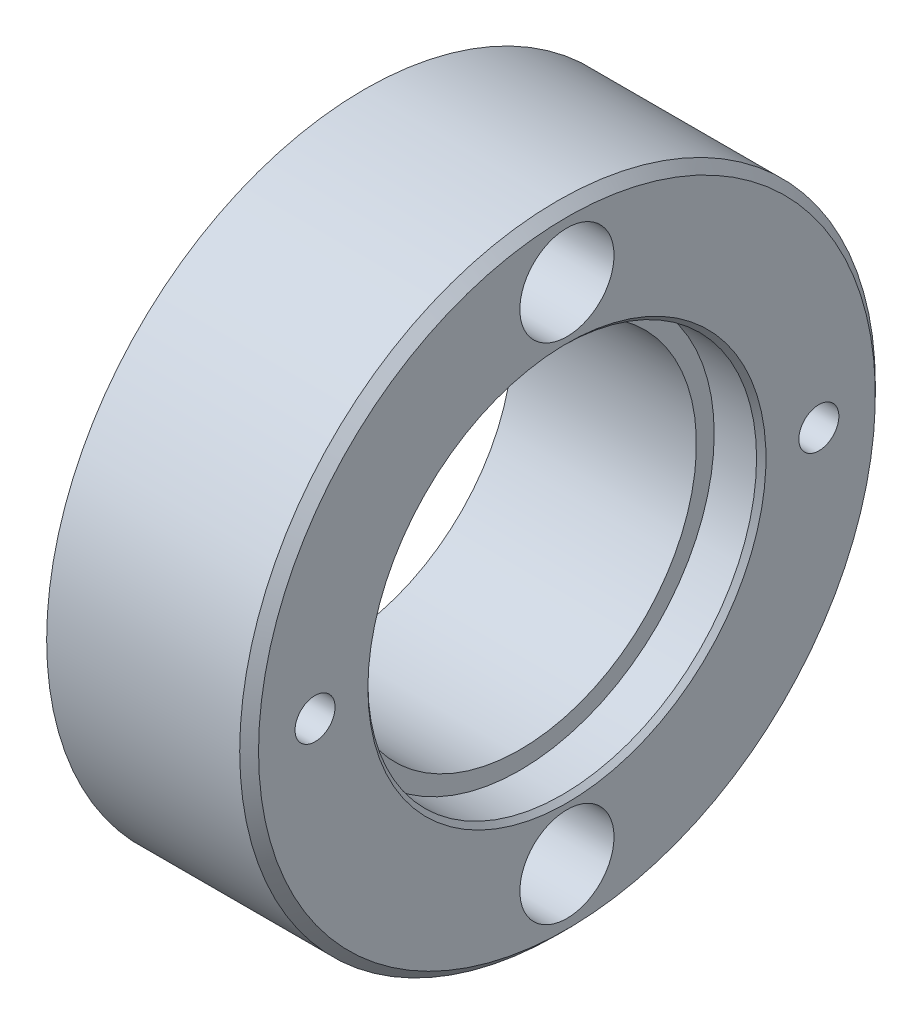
ISO-10303-21;
HEADER;
FILE_DESCRIPTION(('STEP AP214'),'2;1');
FILE_NAME('part.step','',(''),(''),'','','');
FILE_SCHEMA(('AUTOMOTIVE_DESIGN { 1 0 10303 214 1 1 1 1 }'));
ENDSEC;
DATA;
#1=APPLICATION_CONTEXT('core data for automotive mechanical design processes');
#2=APPLICATION_PROTOCOL_DEFINITION('international standard','automotive_design',2000,#1);
#3=PRODUCT_CONTEXT('',#1,'mechanical');
#4=PRODUCT('Part','Part','',(#3));
#5=PRODUCT_RELATED_PRODUCT_CATEGORY('part','',(#4));
#6=PRODUCT_DEFINITION_FORMATION('','',#4);
#7=PRODUCT_DEFINITION_CONTEXT('part definition',#1,'design');
#8=PRODUCT_DEFINITION('design','',#6,#7);
#9=PRODUCT_DEFINITION_SHAPE('','',#8);
#10=(LENGTH_UNIT() NAMED_UNIT(*) SI_UNIT(.MILLI.,.METRE.));
#11=(NAMED_UNIT(*) PLANE_ANGLE_UNIT() SI_UNIT($,.RADIAN.));
#12=(NAMED_UNIT(*) SI_UNIT($,.STERADIAN.) SOLID_ANGLE_UNIT());
#13=UNCERTAINTY_MEASURE_WITH_UNIT(LENGTH_MEASURE(1.E-05),#10,'distance_accuracy_value','');
#14=(GEOMETRIC_REPRESENTATION_CONTEXT(3) GLOBAL_UNCERTAINTY_ASSIGNED_CONTEXT((#13)) GLOBAL_UNIT_ASSIGNED_CONTEXT((#10,
#11,#12)) REPRESENTATION_CONTEXT('',''));
#15=CARTESIAN_POINT('',(0.,0.,0.));
#16=DIRECTION('',(0.,0.,1.));
#17=DIRECTION('',(1.,0.,0.));
#18=AXIS2_PLACEMENT_3D('',#15,#16,#17);
#19=CARTESIAN_POINT('',(49.,42.275,0.));
#20=DIRECTION('',(-1.,0.,0.));
#21=DIRECTION('',(0.,0.,1.));
#22=AXIS2_PLACEMENT_3D('',#19,#20,#21);
#23=PLANE('',#22);
#24=CARTESIAN_POINT('',(49.,-53.5,-1.01507558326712E-12));
#25=DIRECTION('',(1.,0.,0.));
#26=DIRECTION('',(0.,0.,-1.));
#27=AXIS2_PLACEMENT_3D('',#24,#25,#26);
#28=CIRCLE('',#27,10.);
#29=CARTESIAN_POINT('',(49.,-53.5,-10.000000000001));
#30=VERTEX_POINT('',#29);
#31=EDGE_CURVE('E67',#30,#30,#28,.T.);
#32=ORIENTED_EDGE('',*,*,#31,.F.);
#33=EDGE_LOOP('',(#32));
#34=FACE_BOUND('',#33,.T.);
#35=CARTESIAN_POINT('',(49.,0.,0.));
#36=DIRECTION('',(-1.,0.,0.));
#37=DIRECTION('',(0.,0.,1.));
#38=AXIS2_PLACEMENT_3D('',#35,#36,#37);
#39=CIRCLE('',#38,42.275);
#40=CARTESIAN_POINT('',(49.,0.,42.275));
#41=VERTEX_POINT('',#40);
#42=EDGE_CURVE('E98',#41,#41,#39,.T.);
#43=ORIENTED_EDGE('',*,*,#42,.T.);
#44=EDGE_LOOP('',(#43));
#45=FACE_BOUND('',#44,.T.);
#46=CARTESIAN_POINT('',(49.,0.,0.));
#47=DIRECTION('',(-1.,0.,0.));
#48=DIRECTION('',(0.,0.,1.));
#49=AXIS2_PLACEMENT_3D('',#46,#47,#48);
#50=CIRCLE('',#49,65.5);
#51=CARTESIAN_POINT('',(49.,0.,65.5));
#52=VERTEX_POINT('',#51);
#53=EDGE_CURVE('E101',#52,#52,#50,.T.);
#54=ORIENTED_EDGE('',*,*,#53,.F.);
#55=EDGE_LOOP('',(#54));
#56=FACE_BOUND('',#55,.T.);
#57=CARTESIAN_POINT('',(49.,0.,53.5));
#58=DIRECTION('',(1.,0.,0.));
#59=DIRECTION('',(0.,0.,-1.));
#60=AXIS2_PLACEMENT_3D('',#57,#58,#59);
#61=CIRCLE('',#60,4.24999999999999);
#62=CARTESIAN_POINT('',(49.,0.,49.25));
#63=VERTEX_POINT('',#62);
#64=EDGE_CURVE('E83',#63,#63,#61,.T.);
#65=ORIENTED_EDGE('',*,*,#64,.F.);
#66=EDGE_LOOP('',(#65));
#67=FACE_BOUND('',#66,.T.);
#68=CARTESIAN_POINT('',(49.,53.5,0.));
#69=DIRECTION('',(1.,0.,0.));
#70=DIRECTION('',(0.,0.,-1.));
#71=AXIS2_PLACEMENT_3D('',#68,#69,#70);
#72=CIRCLE('',#71,10.);
#73=CARTESIAN_POINT('',(49.,53.5,-10.));
#74=VERTEX_POINT('',#73);
#75=EDGE_CURVE('E76',#74,#74,#72,.T.);
#76=ORIENTED_EDGE('',*,*,#75,.F.);
#77=EDGE_LOOP('',(#76));
#78=FACE_BOUND('',#77,.T.);
#79=CARTESIAN_POINT('',(49.,1.01507558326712E-12,-53.5));
#80=DIRECTION('',(1.,0.,0.));
#81=DIRECTION('',(0.,0.,-1.));
#82=AXIS2_PLACEMENT_3D('',#79,#80,#81);
#83=CIRCLE('',#82,4.24999999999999);
#84=CARTESIAN_POINT('',(49.,1.01507558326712E-12,-57.75));
#85=VERTEX_POINT('',#84);
#86=EDGE_CURVE('E61',#85,#85,#83,.T.);
#87=ORIENTED_EDGE('',*,*,#86,.F.);
#88=EDGE_LOOP('',(#87));
#89=FACE_BOUND('',#88,.T.);
#90=ADVANCED_FACE('F35',(#34,#45,#56,#67,#78,#89),#23,.F.);
#91=CARTESIAN_POINT('',(0.,40.275,0.));
#92=DIRECTION('',(1.,0.,0.));
#93=DIRECTION('',(0.,0.,-1.));
#94=AXIS2_PLACEMENT_3D('',#91,#92,#93);
#95=PLANE('',#94);
#96=CARTESIAN_POINT('',(0.,0.,0.));
#97=DIRECTION('',(-1.,0.,0.));
#98=DIRECTION('',(0.,0.,1.));
#99=AXIS2_PLACEMENT_3D('',#96,#97,#98);
#100=CIRCLE('',#99,37.5);
#101=CARTESIAN_POINT('',(0.,0.,37.5));
#102=VERTEX_POINT('',#101);
#103=EDGE_CURVE('E86',#102,#102,#100,.T.);
#104=ORIENTED_EDGE('',*,*,#103,.F.);
#105=EDGE_LOOP('',(#104));
#106=FACE_BOUND('',#105,.T.);
#107=CARTESIAN_POINT('',(0.,0.,0.));
#108=DIRECTION('',(-1.,0.,0.));
#109=DIRECTION('',(0.,0.,1.));
#110=AXIS2_PLACEMENT_3D('',#107,#108,#109);
#111=CIRCLE('',#110,40.275);
#112=CARTESIAN_POINT('',(0.,0.,40.275));
#113=VERTEX_POINT('',#112);
#114=EDGE_CURVE('E11',#113,#113,#111,.T.);
#115=ORIENTED_EDGE('',*,*,#114,.T.);
#116=EDGE_LOOP('',(#115));
#117=FACE_BOUND('',#116,.T.);
#118=ADVANCED_FACE('F37',(#106,#117),#95,.F.);
#119=CARTESIAN_POINT('',(0.999999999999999,0.,0.));
#120=DIRECTION('',(1.,0.,0.));
#121=DIRECTION('',(0.,0.,-1.));
#122=AXIS2_PLACEMENT_3D('',#119,#120,#121);
#123=CONICAL_SURFACE('',#122,41.275,0.785398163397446);
#124=ORIENTED_EDGE('',*,*,#114,.F.);
#125=EDGE_LOOP('',(#124));
#126=FACE_BOUND('',#125,.T.);
#127=CARTESIAN_POINT('',(0.999999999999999,0.,0.));
#128=DIRECTION('',(-1.,0.,0.));
#129=DIRECTION('',(0.,0.,1.));
#130=AXIS2_PLACEMENT_3D('',#127,#128,#129);
#131=CIRCLE('',#130,41.275);
#132=CARTESIAN_POINT('',(0.999999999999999,0.,41.275));
#133=VERTEX_POINT('',#132);
#134=EDGE_CURVE('E44',#133,#133,#131,.T.);
#135=ORIENTED_EDGE('',*,*,#134,.T.);
#136=EDGE_LOOP('',(#135));
#137=FACE_BOUND('',#136,.T.);
#138=ADVANCED_FACE('F143',(#126,#137),#123,.T.);
#139=CARTESIAN_POINT('',(0.,0.,0.));
#140=DIRECTION('',(-1.,0.,0.));
#141=DIRECTION('',(0.,0.,1.));
#142=AXIS2_PLACEMENT_3D('',#139,#140,#141);
#143=CYLINDRICAL_SURFACE('',#142,41.275);
#144=ORIENTED_EDGE('',*,*,#134,.F.);
#145=EDGE_LOOP('',(#144));
#146=FACE_BOUND('',#145,.T.);
#147=CARTESIAN_POINT('',(6.,0.,0.));
#148=DIRECTION('',(-1.,0.,0.));
#149=DIRECTION('',(0.,0.,1.));
#150=AXIS2_PLACEMENT_3D('',#147,#148,#149);
#151=CIRCLE('',#150,41.275);
#152=CARTESIAN_POINT('',(6.,0.,41.275));
#153=VERTEX_POINT('',#152);
#154=EDGE_CURVE('E110',#153,#153,#151,.T.);
#155=ORIENTED_EDGE('',*,*,#154,.T.);
#156=EDGE_LOOP('',(#155));
#157=FACE_BOUND('',#156,.T.);
#158=ADVANCED_FACE('F161',(#146,#157),#143,.T.);
#159=CARTESIAN_POINT('',(6.,67.5,0.));
#160=DIRECTION('',(1.,0.,0.));
#161=DIRECTION('',(0.,0.,-1.));
#162=AXIS2_PLACEMENT_3D('',#159,#160,#161);
#163=PLANE('',#162);
#164=CARTESIAN_POINT('',(6.,-53.5,-1.01507558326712E-12));
#165=DIRECTION('',(1.,0.,0.));
#166=DIRECTION('',(0.,0.,-1.));
#167=AXIS2_PLACEMENT_3D('',#164,#165,#166);
#168=CIRCLE('',#167,5.49999999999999);
#169=CARTESIAN_POINT('',(6.,-53.5,-5.50000000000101));
#170=VERTEX_POINT('',#169);
#171=EDGE_CURVE('E39',#170,#170,#168,.T.);
#172=ORIENTED_EDGE('',*,*,#171,.T.);
#173=EDGE_LOOP('',(#172));
#174=FACE_BOUND('',#173,.T.);
#175=CARTESIAN_POINT('',(6.,53.5,0.));
#176=DIRECTION('',(1.,0.,0.));
#177=DIRECTION('',(0.,0.,-1.));
#178=AXIS2_PLACEMENT_3D('',#175,#176,#177);
#179=CIRCLE('',#178,5.49999999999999);
#180=CARTESIAN_POINT('',(6.,53.5,-5.49999999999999));
#181=VERTEX_POINT('',#180);
#182=EDGE_CURVE('E79',#181,#181,#179,.T.);
#183=ORIENTED_EDGE('',*,*,#182,.T.);
#184=EDGE_LOOP('',(#183));
#185=FACE_BOUND('',#184,.T.);
#186=ORIENTED_EDGE('',*,*,#154,.F.);
#187=EDGE_LOOP('',(#186));
#188=FACE_BOUND('',#187,.T.);
#189=CARTESIAN_POINT('',(5.99999999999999,0.,0.));
#190=DIRECTION('',(-1.,0.,0.));
#191=DIRECTION('',(0.,0.,1.));
#192=AXIS2_PLACEMENT_3D('',#189,#190,#191);
#193=CIRCLE('',#192,67.5);
#194=CARTESIAN_POINT('',(5.99999999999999,0.,67.5));
#195=VERTEX_POINT('',#194);
#196=EDGE_CURVE('E107',#195,#195,#193,.T.);
#197=ORIENTED_EDGE('',*,*,#196,.T.);
#198=EDGE_LOOP('',(#197));
#199=FACE_BOUND('',#198,.T.);
#200=ADVANCED_FACE('F117',(#174,#185,#188,#199),#163,.F.);
#201=CARTESIAN_POINT('',(0.,0.,0.));
#202=DIRECTION('',(-1.,0.,0.));
#203=DIRECTION('',(0.,0.,1.));
#204=AXIS2_PLACEMENT_3D('',#201,#202,#203);
#205=CYLINDRICAL_SURFACE('',#204,67.5);
#206=ORIENTED_EDGE('',*,*,#196,.F.);
#207=EDGE_LOOP('',(#206));
#208=FACE_BOUND('',#207,.T.);
#209=CARTESIAN_POINT('',(47.,0.,0.));
#210=DIRECTION('',(-1.,0.,0.));
#211=DIRECTION('',(0.,0.,1.));
#212=AXIS2_PLACEMENT_3D('',#209,#210,#211);
#213=CIRCLE('',#212,67.5);
#214=CARTESIAN_POINT('',(47.,0.,67.5));
#215=VERTEX_POINT('',#214);
#216=EDGE_CURVE('E104',#215,#215,#213,.T.);
#217=ORIENTED_EDGE('',*,*,#216,.T.);
#218=EDGE_LOOP('',(#217));
#219=FACE_BOUND('',#218,.T.);
#220=ADVANCED_FACE('F154',(#208,#219),#205,.T.);
#221=CARTESIAN_POINT('',(49.,0.,0.));
#222=DIRECTION('',(-1.,0.,0.));
#223=DIRECTION('',(0.,0.,1.));
#224=AXIS2_PLACEMENT_3D('',#221,#222,#223);
#225=CONICAL_SURFACE('',#224,65.5,0.78539816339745);
#226=ORIENTED_EDGE('',*,*,#216,.F.);
#227=EDGE_LOOP('',(#226));
#228=FACE_BOUND('',#227,.T.);
#229=ORIENTED_EDGE('',*,*,#53,.T.);
#230=EDGE_LOOP('',(#229));
#231=FACE_BOUND('',#230,.T.);
#232=ADVANCED_FACE('F151',(#228,#231),#225,.T.);
#233=CARTESIAN_POINT('',(48.,0.,0.));
#234=DIRECTION('',(1.,0.,0.));
#235=DIRECTION('',(0.,0.,-1.));
#236=AXIS2_PLACEMENT_3D('',#233,#234,#235);
#237=CONICAL_SURFACE('',#236,41.275,0.785398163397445);
#238=ORIENTED_EDGE('',*,*,#42,.F.);
#239=EDGE_LOOP('',(#238));
#240=FACE_BOUND('',#239,.T.);
#241=CARTESIAN_POINT('',(48.,0.,0.));
#242=DIRECTION('',(-1.,0.,0.));
#243=DIRECTION('',(0.,0.,1.));
#244=AXIS2_PLACEMENT_3D('',#241,#242,#243);
#245=CIRCLE('',#244,41.275);
#246=CARTESIAN_POINT('',(48.,0.,41.275));
#247=VERTEX_POINT('',#246);
#248=EDGE_CURVE('E95',#247,#247,#245,.T.);
#249=ORIENTED_EDGE('',*,*,#248,.T.);
#250=EDGE_LOOP('',(#249));
#251=FACE_BOUND('',#250,.T.);
#252=ADVANCED_FACE('F149',(#240,#251),#237,.F.);
#253=CARTESIAN_POINT('',(0.,0.,0.));
#254=DIRECTION('',(-1.,0.,0.));
#255=DIRECTION('',(0.,0.,1.));
#256=AXIS2_PLACEMENT_3D('',#253,#254,#255);
#257=CYLINDRICAL_SURFACE('',#256,41.275);
#258=ORIENTED_EDGE('',*,*,#248,.F.);
#259=EDGE_LOOP('',(#258));
#260=FACE_BOUND('',#259,.T.);
#261=CARTESIAN_POINT('',(39.,0.,0.));
#262=DIRECTION('',(-1.,0.,0.));
#263=DIRECTION('',(0.,0.,1.));
#264=AXIS2_PLACEMENT_3D('',#261,#262,#263);
#265=CIRCLE('',#264,41.275);
#266=CARTESIAN_POINT('',(39.,0.,41.275));
#267=VERTEX_POINT('',#266);
#268=EDGE_CURVE('E92',#267,#267,#265,.T.);
#269=ORIENTED_EDGE('',*,*,#268,.T.);
#270=EDGE_LOOP('',(#269));
#271=FACE_BOUND('',#270,.T.);
#272=ADVANCED_FACE('F294',(#260,#271),#257,.F.);
#273=CARTESIAN_POINT('',(39.,37.5,0.));
#274=DIRECTION('',(-1.,0.,0.));
#275=DIRECTION('',(0.,0.,1.));
#276=AXIS2_PLACEMENT_3D('',#273,#274,#275);
#277=PLANE('',#276);
#278=ORIENTED_EDGE('',*,*,#268,.F.);
#279=EDGE_LOOP('',(#278));
#280=FACE_BOUND('',#279,.T.);
#281=CARTESIAN_POINT('',(39.,0.,0.));
#282=DIRECTION('',(-1.,0.,0.));
#283=DIRECTION('',(0.,0.,1.));
#284=AXIS2_PLACEMENT_3D('',#281,#282,#283);
#285=CIRCLE('',#284,37.5);
#286=CARTESIAN_POINT('',(39.,0.,37.5));
#287=VERTEX_POINT('',#286);
#288=EDGE_CURVE('E89',#287,#287,#285,.T.);
#289=ORIENTED_EDGE('',*,*,#288,.T.);
#290=EDGE_LOOP('',(#289));
#291=FACE_BOUND('',#290,.T.);
#292=ADVANCED_FACE('F285',(#280,#291),#277,.F.);
#293=CARTESIAN_POINT('',(0.,0.,0.));
#294=DIRECTION('',(-1.,0.,0.));
#295=DIRECTION('',(0.,0.,1.));
#296=AXIS2_PLACEMENT_3D('',#293,#294,#295);
#297=CYLINDRICAL_SURFACE('',#296,37.5);
#298=ORIENTED_EDGE('',*,*,#288,.F.);
#299=EDGE_LOOP('',(#298));
#300=FACE_BOUND('',#299,.T.);
#301=ORIENTED_EDGE('',*,*,#103,.T.);
#302=EDGE_LOOP('',(#301));
#303=FACE_BOUND('',#302,.T.);
#304=ADVANCED_FACE('F275',(#300,#303),#297,.F.);
#305=CARTESIAN_POINT('',(49.,0.,53.5));
#306=DIRECTION('',(1.,0.,0.));
#307=DIRECTION('',(0.,0.,-1.));
#308=AXIS2_PLACEMENT_3D('',#305,#306,#307);
#309=CYLINDRICAL_SURFACE('',#308,4.24999999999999);
#310=CARTESIAN_POINT('',(19.,0.,53.5));
#311=DIRECTION('',(1.,0.,0.));
#312=DIRECTION('',(0.,0.,-1.));
#313=AXIS2_PLACEMENT_3D('',#310,#311,#312);
#314=CIRCLE('',#313,4.24999999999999);
#315=CARTESIAN_POINT('',(19.,0.,49.25));
#316=VERTEX_POINT('',#315);
#317=EDGE_CURVE('E80',#316,#316,#314,.T.);
#318=ORIENTED_EDGE('',*,*,#317,.F.);
#319=EDGE_LOOP('',(#318));
#320=FACE_BOUND('',#319,.T.);
#321=ORIENTED_EDGE('',*,*,#64,.T.);
#322=EDGE_LOOP('',(#321));
#323=FACE_BOUND('',#322,.T.);
#324=ADVANCED_FACE('F133',(#320,#323),#309,.F.);
#325=CARTESIAN_POINT('',(19.,0.,53.5));
#326=DIRECTION('',(1.,0.,0.));
#327=DIRECTION('',(0.,0.,-1.));
#328=AXIS2_PLACEMENT_3D('',#325,#326,#327);
#329=CONICAL_SURFACE('',#328,4.24999999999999,1.02974425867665);
#330=CARTESIAN_POINT('',(16.4463423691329,0.,53.5));
#331=VERTEX_POINT('',#330);
#332=VERTEX_LOOP('',#331);
#333=FACE_BOUND('',#332,.T.);
#334=ORIENTED_EDGE('',*,*,#317,.T.);
#335=EDGE_LOOP('',(#334));
#336=FACE_BOUND('',#335,.T.);
#337=ADVANCED_FACE('F123',(#333,#336),#329,.F.);
#338=CARTESIAN_POINT('',(49.,53.5,0.));
#339=DIRECTION('',(1.,0.,0.));
#340=DIRECTION('',(0.,0.,-1.));
#341=AXIS2_PLACEMENT_3D('',#338,#339,#340);
#342=CYLINDRICAL_SURFACE('',#341,5.49999999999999);
#343=CARTESIAN_POINT('',(29.,53.5,0.));
#344=DIRECTION('',(1.,0.,0.));
#345=DIRECTION('',(0.,0.,-1.));
#346=AXIS2_PLACEMENT_3D('',#343,#344,#345);
#347=CIRCLE('',#346,5.5);
#348=CARTESIAN_POINT('',(29.,53.5,-5.5));
#349=VERTEX_POINT('',#348);
#350=EDGE_CURVE('E64',#349,#349,#347,.T.);
#351=ORIENTED_EDGE('',*,*,#350,.T.);
#352=EDGE_LOOP('',(#351));
#353=FACE_BOUND('',#352,.T.);
#354=ORIENTED_EDGE('',*,*,#182,.F.);
#355=EDGE_LOOP('',(#354));
#356=FACE_BOUND('',#355,.T.);
#357=ADVANCED_FACE('F120',(#353,#356),#342,.F.);
#358=CARTESIAN_POINT('',(49.,53.5,0.));
#359=DIRECTION('',(1.,0.,0.));
#360=DIRECTION('',(0.,0.,-1.));
#361=AXIS2_PLACEMENT_3D('',#358,#359,#360);
#362=CYLINDRICAL_SURFACE('',#361,10.);
#363=CARTESIAN_POINT('',(29.,53.5,0.));
#364=DIRECTION('',(1.,0.,0.));
#365=DIRECTION('',(0.,0.,-1.));
#366=AXIS2_PLACEMENT_3D('',#363,#364,#365);
#367=CIRCLE('',#366,10.);
#368=CARTESIAN_POINT('',(29.,53.5,-10.));
#369=VERTEX_POINT('',#368);
#370=EDGE_CURVE('E73',#369,#369,#367,.T.);
#371=ORIENTED_EDGE('',*,*,#370,.F.);
#372=EDGE_LOOP('',(#371));
#373=FACE_BOUND('',#372,.T.);
#374=ORIENTED_EDGE('',*,*,#75,.T.);
#375=EDGE_LOOP('',(#374));
#376=FACE_BOUND('',#375,.T.);
#377=ADVANCED_FACE('F122',(#373,#376),#362,.F.);
#378=CARTESIAN_POINT('',(29.,59.,0.));
#379=DIRECTION('',(-1.,0.,0.));
#380=DIRECTION('',(0.,0.,1.));
#381=AXIS2_PLACEMENT_3D('',#378,#379,#380);
#382=PLANE('',#381);
#383=ORIENTED_EDGE('',*,*,#350,.F.);
#384=EDGE_LOOP('',(#383));
#385=FACE_BOUND('',#384,.T.);
#386=ORIENTED_EDGE('',*,*,#370,.T.);
#387=EDGE_LOOP('',(#386));
#388=FACE_BOUND('',#387,.T.);
#389=ADVANCED_FACE('F130',(#385,#388),#382,.F.);
#390=CARTESIAN_POINT('',(49.,1.01507558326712E-12,-53.5));
#391=DIRECTION('',(1.,0.,0.));
#392=DIRECTION('',(0.,0.,-1.));
#393=AXIS2_PLACEMENT_3D('',#390,#391,#392);
#394=CYLINDRICAL_SURFACE('',#393,4.24999999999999);
#395=CARTESIAN_POINT('',(19.,1.01507558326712E-12,-53.5));
#396=DIRECTION('',(1.,0.,0.));
#397=DIRECTION('',(0.,0.,-1.));
#398=AXIS2_PLACEMENT_3D('',#395,#396,#397);
#399=CIRCLE('',#398,4.24999999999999);
#400=CARTESIAN_POINT('',(19.,1.01507558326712E-12,-57.75));
#401=VERTEX_POINT('',#400);
#402=EDGE_CURVE('E59',#401,#401,#399,.T.);
#403=ORIENTED_EDGE('',*,*,#402,.F.);
#404=EDGE_LOOP('',(#403));
#405=FACE_BOUND('',#404,.T.);
#406=ORIENTED_EDGE('',*,*,#86,.T.);
#407=EDGE_LOOP('',(#406));
#408=FACE_BOUND('',#407,.T.);
#409=ADVANCED_FACE('F55',(#405,#408),#394,.F.);
#410=CARTESIAN_POINT('',(19.,1.01507558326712E-12,-53.5));
#411=DIRECTION('',(1.,0.,0.));
#412=DIRECTION('',(0.,0.,-1.));
#413=AXIS2_PLACEMENT_3D('',#410,#411,#412);
#414=CONICAL_SURFACE('',#413,4.24999999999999,1.02974425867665);
#415=CARTESIAN_POINT('',(16.4463423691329,1.00710250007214E-12,-53.5));
#416=VERTEX_POINT('',#415);
#417=VERTEX_LOOP('',#416);
#418=FACE_BOUND('',#417,.T.);
#419=ORIENTED_EDGE('',*,*,#402,.T.);
#420=EDGE_LOOP('',(#419));
#421=FACE_BOUND('',#420,.T.);
#422=ADVANCED_FACE('F51',(#418,#421),#414,.F.);
#423=CARTESIAN_POINT('',(49.,-53.5,-1.01507558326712E-12));
#424=DIRECTION('',(1.,0.,0.));
#425=DIRECTION('',(0.,0.,-1.));
#426=AXIS2_PLACEMENT_3D('',#423,#424,#425);
#427=CYLINDRICAL_SURFACE('',#426,5.49999999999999);
#428=CARTESIAN_POINT('',(29.,-53.5,-1.01507558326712E-12));
#429=DIRECTION('',(1.,0.,0.));
#430=DIRECTION('',(0.,0.,-1.));
#431=AXIS2_PLACEMENT_3D('',#428,#429,#430);
#432=CIRCLE('',#431,5.5);
#433=CARTESIAN_POINT('',(29.,-53.5,-5.50000000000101));
#434=VERTEX_POINT('',#433);
#435=EDGE_CURVE('E209',#434,#434,#432,.T.);
#436=ORIENTED_EDGE('',*,*,#435,.T.);
#437=EDGE_LOOP('',(#436));
#438=FACE_BOUND('',#437,.T.);
#439=ORIENTED_EDGE('',*,*,#171,.F.);
#440=EDGE_LOOP('',(#439));
#441=FACE_BOUND('',#440,.T.);
#442=ADVANCED_FACE('F54',(#438,#441),#427,.F.);
#443=CARTESIAN_POINT('',(49.,-53.5,-1.01507558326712E-12));
#444=DIRECTION('',(1.,0.,0.));
#445=DIRECTION('',(0.,0.,-1.));
#446=AXIS2_PLACEMENT_3D('',#443,#444,#445);
#447=CYLINDRICAL_SURFACE('',#446,10.);
#448=CARTESIAN_POINT('',(29.,-53.5,-1.01507558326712E-12));
#449=DIRECTION('',(1.,0.,0.));
#450=DIRECTION('',(0.,0.,-1.));
#451=AXIS2_PLACEMENT_3D('',#448,#449,#450);
#452=CIRCLE('',#451,10.);
#453=CARTESIAN_POINT('',(29.,-53.5,-10.000000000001));
#454=VERTEX_POINT('',#453);
#455=EDGE_CURVE('E211',#454,#454,#452,.T.);
#456=ORIENTED_EDGE('',*,*,#455,.F.);
#457=EDGE_LOOP('',(#456));
#458=FACE_BOUND('',#457,.T.);
#459=ORIENTED_EDGE('',*,*,#31,.T.);
#460=EDGE_LOOP('',(#459));
#461=FACE_BOUND('',#460,.T.);
#462=ADVANCED_FACE('F194',(#458,#461),#447,.F.);
#463=CARTESIAN_POINT('',(29.,-48.,-1.01507558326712E-12));
#464=DIRECTION('',(-1.,0.,0.));
#465=DIRECTION('',(0.,0.,1.));
#466=AXIS2_PLACEMENT_3D('',#463,#464,#465);
#467=PLANE('',#466);
#468=ORIENTED_EDGE('',*,*,#435,.F.);
#469=EDGE_LOOP('',(#468));
#470=FACE_BOUND('',#469,.T.);
#471=ORIENTED_EDGE('',*,*,#455,.T.);
#472=EDGE_LOOP('',(#471));
#473=FACE_BOUND('',#472,.T.);
#474=ADVANCED_FACE('F197',(#470,#473),#467,.F.);
#475=CLOSED_SHELL('',(#90,#118,#138,#158,#200,#220,#232,#252,#272,#292,#304,#324,#337,#357,#377,
#389,#409,#422,#442,#462,#474));
#476=MANIFOLD_SOLID_BREP('B2',#475);
#477=ADVANCED_BREP_SHAPE_REPRESENTATION('',(#18,#476),#14);
#478=SHAPE_DEFINITION_REPRESENTATION(#9,#477);
ENDSEC;
END-ISO-10303-21;
